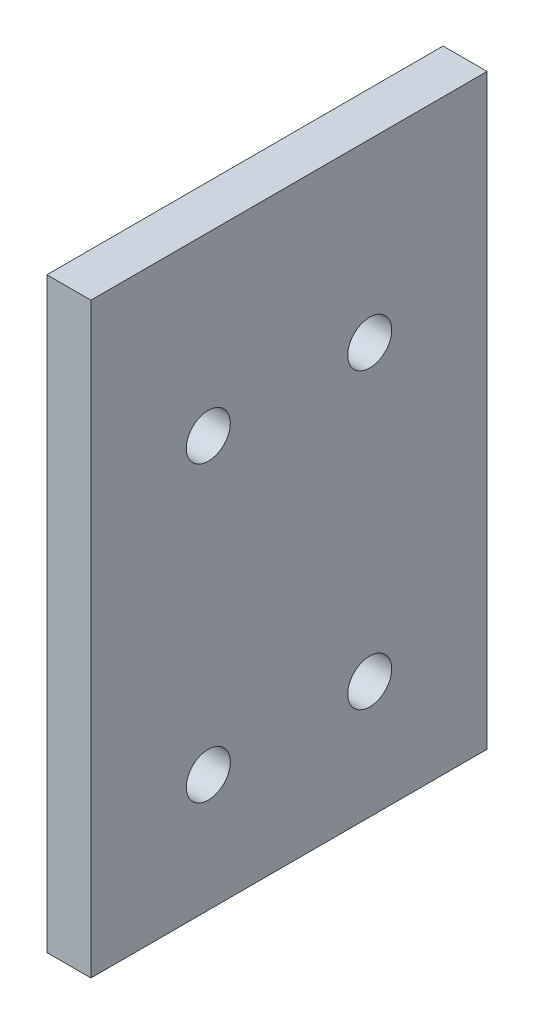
ISO-10303-21;
HEADER;
FILE_DESCRIPTION(('STEP AP214'),'2;1');
FILE_NAME('part.step','',(''),(''),'','','');
FILE_SCHEMA(('AUTOMOTIVE_DESIGN { 1 0 10303 214 1 1 1 1 }'));
ENDSEC;
DATA;
#1=APPLICATION_CONTEXT('core data for automotive mechanical design processes');
#2=APPLICATION_PROTOCOL_DEFINITION('international standard','automotive_design',2000,#1);
#3=PRODUCT_CONTEXT('',#1,'mechanical');
#4=PRODUCT('Part','Part','',(#3));
#5=PRODUCT_RELATED_PRODUCT_CATEGORY('part','',(#4));
#6=PRODUCT_DEFINITION_FORMATION('','',#4);
#7=PRODUCT_DEFINITION_CONTEXT('part definition',#1,'design');
#8=PRODUCT_DEFINITION('design','',#6,#7);
#9=PRODUCT_DEFINITION_SHAPE('','',#8);
#10=(LENGTH_UNIT() NAMED_UNIT(*) SI_UNIT(.MILLI.,.METRE.));
#11=(NAMED_UNIT(*) PLANE_ANGLE_UNIT() SI_UNIT($,.RADIAN.));
#12=(NAMED_UNIT(*) SI_UNIT($,.STERADIAN.) SOLID_ANGLE_UNIT());
#13=UNCERTAINTY_MEASURE_WITH_UNIT(LENGTH_MEASURE(1.E-05),#10,'distance_accuracy_value','');
#14=(GEOMETRIC_REPRESENTATION_CONTEXT(3) GLOBAL_UNCERTAINTY_ASSIGNED_CONTEXT((#13)) GLOBAL_UNIT_ASSIGNED_CONTEXT((#10,
#11,#12)) REPRESENTATION_CONTEXT('',''));
#15=CARTESIAN_POINT('',(0.,0.,0.));
#16=DIRECTION('',(0.,0.,1.));
#17=DIRECTION('',(1.,0.,0.));
#18=AXIS2_PLACEMENT_3D('',#15,#16,#17);
#19=CARTESIAN_POINT('',(3.,0.,0.));
#20=DIRECTION('',(1.,0.,0.));
#21=DIRECTION('',(0.,0.,-1.));
#22=AXIS2_PLACEMENT_3D('',#19,#20,#21);
#23=PLANE('',#22);
#24=CARTESIAN_POINT('',(3.,-12.,5.5));
#25=DIRECTION('',(1.,0.,0.));
#26=DIRECTION('',(0.,0.,-1.));
#27=AXIS2_PLACEMENT_3D('',#24,#25,#26);
#28=CIRCLE('',#27,1.5);
#29=CARTESIAN_POINT('',(3.,-12.,4.));
#30=VERTEX_POINT('',#29);
#31=EDGE_CURVE('E121',#30,#30,#28,.T.);
#32=ORIENTED_EDGE('',*,*,#31,.F.);
#33=EDGE_LOOP('',(#32));
#34=FACE_BOUND('',#33,.T.);
#35=CARTESIAN_POINT('',(3.,8.,5.5));
#36=DIRECTION('',(1.,0.,0.));
#37=DIRECTION('',(0.,0.,-1.));
#38=AXIS2_PLACEMENT_3D('',#35,#36,#37);
#39=CIRCLE('',#38,1.5);
#40=CARTESIAN_POINT('',(3.,8.,4.));
#41=VERTEX_POINT('',#40);
#42=EDGE_CURVE('E100',#41,#41,#39,.T.);
#43=ORIENTED_EDGE('',*,*,#42,.F.);
#44=EDGE_LOOP('',(#43));
#45=FACE_BOUND('',#44,.T.);
#46=DIRECTION('',(0.,1.,0.));
#47=VECTOR('',#46,1.);
#48=CARTESIAN_POINT('',(3.,20.,-13.5));
#49=LINE('',#48,#47);
#50=CARTESIAN_POINT('',(3.,-20.,-13.5));
#51=VERTEX_POINT('',#50);
#52=CARTESIAN_POINT('',(3.,20.,-13.5));
#53=VERTEX_POINT('',#52);
#54=EDGE_CURVE('E85',#51,#53,#49,.T.);
#55=ORIENTED_EDGE('',*,*,#54,.T.);
#56=DIRECTION('',(0.,0.,1.));
#57=VECTOR('',#56,1.);
#58=CARTESIAN_POINT('',(3.,20.,13.5));
#59=LINE('',#58,#57);
#60=CARTESIAN_POINT('',(3.,20.,13.5));
#61=VERTEX_POINT('',#60);
#62=EDGE_CURVE('E80',#53,#61,#59,.T.);
#63=ORIENTED_EDGE('',*,*,#62,.T.);
#64=DIRECTION('',(0.,-1.,0.));
#65=VECTOR('',#64,1.);
#66=CARTESIAN_POINT('',(3.,20.,13.5));
#67=LINE('',#66,#65);
#68=CARTESIAN_POINT('',(3.,-20.,13.5));
#69=VERTEX_POINT('',#68);
#70=EDGE_CURVE('E83',#61,#69,#67,.T.);
#71=ORIENTED_EDGE('',*,*,#70,.T.);
#72=DIRECTION('',(0.,0.,-1.));
#73=VECTOR('',#72,1.);
#74=CARTESIAN_POINT('',(3.,-20.,13.5));
#75=LINE('',#74,#73);
#76=EDGE_CURVE('E50',#69,#51,#75,.T.);
#77=ORIENTED_EDGE('',*,*,#76,.T.);
#78=EDGE_LOOP('',(#55,#63,#71,#77));
#79=FACE_BOUND('',#78,.T.);
#80=CARTESIAN_POINT('',(3.,8.,-5.5));
#81=DIRECTION('',(1.,0.,0.));
#82=DIRECTION('',(0.,0.,-1.));
#83=AXIS2_PLACEMENT_3D('',#80,#81,#82);
#84=CIRCLE('',#83,1.5);
#85=CARTESIAN_POINT('',(3.,8.,-7.));
#86=VERTEX_POINT('',#85);
#87=EDGE_CURVE('E115',#86,#86,#84,.T.);
#88=ORIENTED_EDGE('',*,*,#87,.F.);
#89=EDGE_LOOP('',(#88));
#90=FACE_BOUND('',#89,.T.);
#91=CARTESIAN_POINT('',(3.,-12.,-5.5));
#92=DIRECTION('',(1.,0.,0.));
#93=DIRECTION('',(0.,0.,-1.));
#94=AXIS2_PLACEMENT_3D('',#91,#92,#93);
#95=CIRCLE('',#94,1.5);
#96=CARTESIAN_POINT('',(3.,-12.,-7.));
#97=VERTEX_POINT('',#96);
#98=EDGE_CURVE('E127',#97,#97,#95,.T.);
#99=ORIENTED_EDGE('',*,*,#98,.F.);
#100=EDGE_LOOP('',(#99));
#101=FACE_BOUND('',#100,.T.);
#102=ADVANCED_FACE('F33',(#34,#45,#79,#90,#101),#23,.T.);
#103=CARTESIAN_POINT('',(0.,0.,0.));
#104=DIRECTION('',(1.,0.,0.));
#105=DIRECTION('',(0.,0.,-1.));
#106=AXIS2_PLACEMENT_3D('',#103,#104,#105);
#107=PLANE('',#106);
#108=DIRECTION('',(0.,1.,0.));
#109=VECTOR('',#108,1.);
#110=CARTESIAN_POINT('',(0.,20.,-13.5));
#111=LINE('',#110,#109);
#112=CARTESIAN_POINT('',(0.,-20.,-13.5));
#113=VERTEX_POINT('',#112);
#114=CARTESIAN_POINT('',(0.,20.,-13.5));
#115=VERTEX_POINT('',#114);
#116=EDGE_CURVE('E97',#113,#115,#111,.T.);
#117=ORIENTED_EDGE('',*,*,#116,.F.);
#118=DIRECTION('',(0.,0.,-1.));
#119=VECTOR('',#118,1.);
#120=CARTESIAN_POINT('',(0.,-20.,13.5));
#121=LINE('',#120,#119);
#122=CARTESIAN_POINT('',(0.,-20.,13.5));
#123=VERTEX_POINT('',#122);
#124=EDGE_CURVE('E73',#123,#113,#121,.T.);
#125=ORIENTED_EDGE('',*,*,#124,.F.);
#126=DIRECTION('',(0.,-1.,0.));
#127=VECTOR('',#126,1.);
#128=CARTESIAN_POINT('',(0.,20.,13.5));
#129=LINE('',#128,#127);
#130=CARTESIAN_POINT('',(0.,20.,13.5));
#131=VERTEX_POINT('',#130);
#132=EDGE_CURVE('E67',#131,#123,#129,.T.);
#133=ORIENTED_EDGE('',*,*,#132,.F.);
#134=DIRECTION('',(0.,0.,1.));
#135=VECTOR('',#134,1.);
#136=CARTESIAN_POINT('',(0.,20.,13.5));
#137=LINE('',#136,#135);
#138=EDGE_CURVE('E89',#115,#131,#137,.T.);
#139=ORIENTED_EDGE('',*,*,#138,.F.);
#140=EDGE_LOOP('',(#117,#125,#133,#139));
#141=FACE_BOUND('',#140,.T.);
#142=CARTESIAN_POINT('',(0.,8.,5.5));
#143=DIRECTION('',(1.,0.,0.));
#144=DIRECTION('',(0.,0.,-1.));
#145=AXIS2_PLACEMENT_3D('',#142,#143,#144);
#146=CIRCLE('',#145,1.5);
#147=CARTESIAN_POINT('',(0.,8.,4.));
#148=VERTEX_POINT('',#147);
#149=EDGE_CURVE('E112',#148,#148,#146,.T.);
#150=ORIENTED_EDGE('',*,*,#149,.T.);
#151=EDGE_LOOP('',(#150));
#152=FACE_BOUND('',#151,.T.);
#153=CARTESIAN_POINT('',(0.,8.,-5.5));
#154=DIRECTION('',(1.,0.,0.));
#155=DIRECTION('',(0.,0.,-1.));
#156=AXIS2_PLACEMENT_3D('',#153,#154,#155);
#157=CIRCLE('',#156,1.5);
#158=CARTESIAN_POINT('',(0.,8.,-7.));
#159=VERTEX_POINT('',#158);
#160=EDGE_CURVE('E118',#159,#159,#157,.T.);
#161=ORIENTED_EDGE('',*,*,#160,.T.);
#162=EDGE_LOOP('',(#161));
#163=FACE_BOUND('',#162,.T.);
#164=CARTESIAN_POINT('',(0.,-12.,5.5));
#165=DIRECTION('',(1.,0.,0.));
#166=DIRECTION('',(0.,0.,-1.));
#167=AXIS2_PLACEMENT_3D('',#164,#165,#166);
#168=CIRCLE('',#167,1.5);
#169=CARTESIAN_POINT('',(0.,-12.,4.));
#170=VERTEX_POINT('',#169);
#171=EDGE_CURVE('E124',#170,#170,#168,.T.);
#172=ORIENTED_EDGE('',*,*,#171,.T.);
#173=EDGE_LOOP('',(#172));
#174=FACE_BOUND('',#173,.T.);
#175=CARTESIAN_POINT('',(0.,-12.,-5.5));
#176=DIRECTION('',(1.,0.,0.));
#177=DIRECTION('',(0.,0.,-1.));
#178=AXIS2_PLACEMENT_3D('',#175,#176,#177);
#179=CIRCLE('',#178,1.5);
#180=CARTESIAN_POINT('',(0.,-12.,-7.));
#181=VERTEX_POINT('',#180);
#182=EDGE_CURVE('E130',#181,#181,#179,.T.);
#183=ORIENTED_EDGE('',*,*,#182,.T.);
#184=EDGE_LOOP('',(#183));
#185=FACE_BOUND('',#184,.T.);
#186=ADVANCED_FACE('F108',(#141,#152,#163,#174,#185),#107,.F.);
#187=CARTESIAN_POINT('',(3.,20.,-13.5));
#188=DIRECTION('',(0.,0.,1.));
#189=DIRECTION('',(0.,-1.,0.));
#190=AXIS2_PLACEMENT_3D('',#187,#188,#189);
#191=PLANE('',#190);
#192=ORIENTED_EDGE('',*,*,#116,.T.);
#193=DIRECTION('',(-1.,0.,0.));
#194=VECTOR('',#193,1.);
#195=CARTESIAN_POINT('',(3.,20.,-13.5));
#196=LINE('',#195,#194);
#197=EDGE_CURVE('E11',#53,#115,#196,.T.);
#198=ORIENTED_EDGE('',*,*,#197,.F.);
#199=ORIENTED_EDGE('',*,*,#54,.F.);
#200=DIRECTION('',(-1.,0.,0.));
#201=VECTOR('',#200,1.);
#202=CARTESIAN_POINT('',(3.,-20.,-13.5));
#203=LINE('',#202,#201);
#204=EDGE_CURVE('E93',#51,#113,#203,.T.);
#205=ORIENTED_EDGE('',*,*,#204,.T.);
#206=EDGE_LOOP('',(#192,#198,#199,#205));
#207=FACE_BOUND('',#206,.T.);
#208=ADVANCED_FACE('F35',(#207),#191,.F.);
#209=CARTESIAN_POINT('',(3.,20.,13.5));
#210=DIRECTION('',(0.,-1.,0.));
#211=DIRECTION('',(0.,0.,-1.));
#212=AXIS2_PLACEMENT_3D('',#209,#210,#211);
#213=PLANE('',#212);
#214=ORIENTED_EDGE('',*,*,#138,.T.);
#215=DIRECTION('',(-1.,0.,0.));
#216=VECTOR('',#215,1.);
#217=CARTESIAN_POINT('',(3.,20.,13.5));
#218=LINE('',#217,#216);
#219=EDGE_CURVE('E42',#61,#131,#218,.T.);
#220=ORIENTED_EDGE('',*,*,#219,.F.);
#221=ORIENTED_EDGE('',*,*,#62,.F.);
#222=ORIENTED_EDGE('',*,*,#197,.T.);
#223=EDGE_LOOP('',(#214,#220,#221,#222));
#224=FACE_BOUND('',#223,.T.);
#225=ADVANCED_FACE('F88',(#224),#213,.F.);
#226=CARTESIAN_POINT('',(3.,20.,13.5));
#227=DIRECTION('',(0.,0.,-1.));
#228=DIRECTION('',(0.,1.,0.));
#229=AXIS2_PLACEMENT_3D('',#226,#227,#228);
#230=PLANE('',#229);
#231=ORIENTED_EDGE('',*,*,#132,.T.);
#232=DIRECTION('',(-1.,0.,0.));
#233=VECTOR('',#232,1.);
#234=CARTESIAN_POINT('',(3.,-20.,13.5));
#235=LINE('',#234,#233);
#236=EDGE_CURVE('E90',#69,#123,#235,.T.);
#237=ORIENTED_EDGE('',*,*,#236,.F.);
#238=ORIENTED_EDGE('',*,*,#70,.F.);
#239=ORIENTED_EDGE('',*,*,#219,.T.);
#240=EDGE_LOOP('',(#231,#237,#238,#239));
#241=FACE_BOUND('',#240,.T.);
#242=ADVANCED_FACE('F91',(#241),#230,.F.);
#243=CARTESIAN_POINT('',(3.,-20.,13.5));
#244=DIRECTION('',(0.,1.,0.));
#245=DIRECTION('',(0.,0.,1.));
#246=AXIS2_PLACEMENT_3D('',#243,#244,#245);
#247=PLANE('',#246);
#248=ORIENTED_EDGE('',*,*,#124,.T.);
#249=ORIENTED_EDGE('',*,*,#204,.F.);
#250=ORIENTED_EDGE('',*,*,#76,.F.);
#251=ORIENTED_EDGE('',*,*,#236,.T.);
#252=EDGE_LOOP('',(#248,#249,#250,#251));
#253=FACE_BOUND('',#252,.T.);
#254=ADVANCED_FACE('F105',(#253),#247,.F.);
#255=CARTESIAN_POINT('',(3.,8.,5.5));
#256=DIRECTION('',(-1.,0.,0.));
#257=DIRECTION('',(0.,0.,1.));
#258=AXIS2_PLACEMENT_3D('',#255,#256,#257);
#259=CYLINDRICAL_SURFACE('',#258,1.5);
#260=ORIENTED_EDGE('',*,*,#42,.T.);
#261=EDGE_LOOP('',(#260));
#262=FACE_BOUND('',#261,.T.);
#263=ORIENTED_EDGE('',*,*,#149,.F.);
#264=EDGE_LOOP('',(#263));
#265=FACE_BOUND('',#264,.T.);
#266=ADVANCED_FACE('F149',(#262,#265),#259,.F.);
#267=CARTESIAN_POINT('',(3.,8.,-5.5));
#268=DIRECTION('',(-1.,0.,0.));
#269=DIRECTION('',(0.,0.,1.));
#270=AXIS2_PLACEMENT_3D('',#267,#268,#269);
#271=CYLINDRICAL_SURFACE('',#270,1.5);
#272=ORIENTED_EDGE('',*,*,#87,.T.);
#273=EDGE_LOOP('',(#272));
#274=FACE_BOUND('',#273,.T.);
#275=ORIENTED_EDGE('',*,*,#160,.F.);
#276=EDGE_LOOP('',(#275));
#277=FACE_BOUND('',#276,.T.);
#278=ADVANCED_FACE('F195',(#274,#277),#271,.F.);
#279=CARTESIAN_POINT('',(3.,-12.,5.5));
#280=DIRECTION('',(-1.,0.,0.));
#281=DIRECTION('',(0.,0.,1.));
#282=AXIS2_PLACEMENT_3D('',#279,#280,#281);
#283=CYLINDRICAL_SURFACE('',#282,1.5);
#284=ORIENTED_EDGE('',*,*,#31,.T.);
#285=EDGE_LOOP('',(#284));
#286=FACE_BOUND('',#285,.T.);
#287=ORIENTED_EDGE('',*,*,#171,.F.);
#288=EDGE_LOOP('',(#287));
#289=FACE_BOUND('',#288,.T.);
#290=ADVANCED_FACE('F203',(#286,#289),#283,.F.);
#291=CARTESIAN_POINT('',(3.,-12.,-5.5));
#292=DIRECTION('',(-1.,0.,0.));
#293=DIRECTION('',(0.,0.,1.));
#294=AXIS2_PLACEMENT_3D('',#291,#292,#293);
#295=CYLINDRICAL_SURFACE('',#294,1.5);
#296=ORIENTED_EDGE('',*,*,#98,.T.);
#297=EDGE_LOOP('',(#296));
#298=FACE_BOUND('',#297,.T.);
#299=ORIENTED_EDGE('',*,*,#182,.F.);
#300=EDGE_LOOP('',(#299));
#301=FACE_BOUND('',#300,.T.);
#302=ADVANCED_FACE('F136',(#298,#301),#295,.F.);
#303=CLOSED_SHELL('',(#102,#186,#208,#225,#242,#254,#266,#278,#290,#302));
#304=MANIFOLD_SOLID_BREP('B2',#303);
#305=ADVANCED_BREP_SHAPE_REPRESENTATION('',(#18,#304),#14);
#306=SHAPE_DEFINITION_REPRESENTATION(#9,#305);
ENDSEC;
END-ISO-10303-21;
